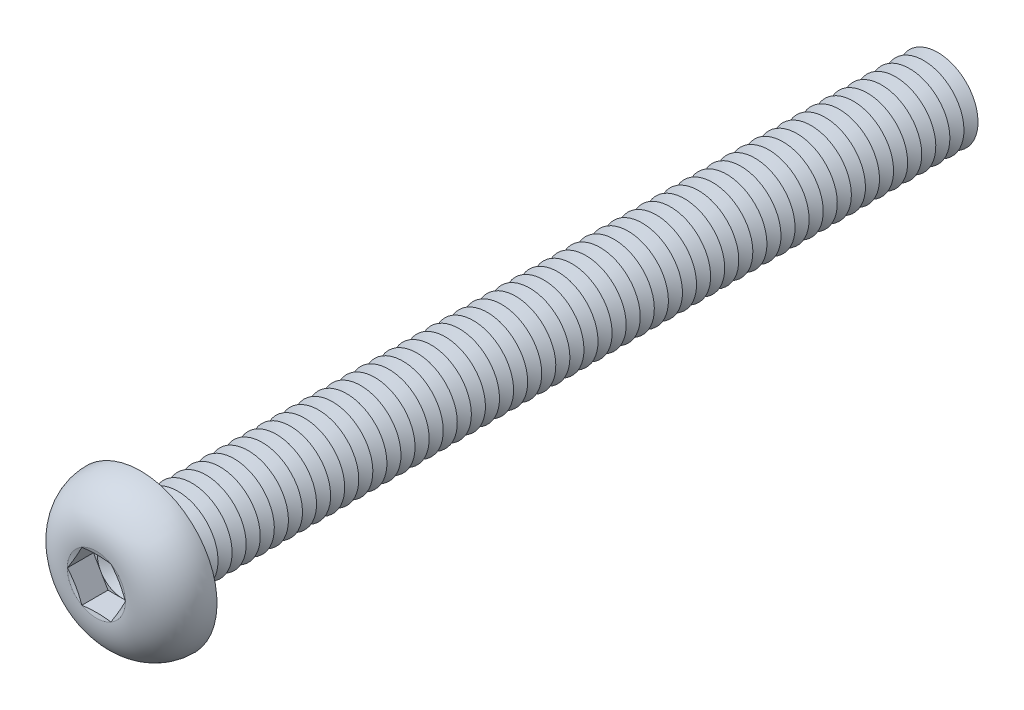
from build123d import *

# Parameters (mm, degrees)
FILLET1_R          = 0.35
LPATTERN1_COUNT    = 57
LPATTERN1_PITCH    = 0.7
CUT_EXTRUDE1_DEPTH = 1.3


with BuildPart() as part:
    # Sketch1 → Revolve1 (revolve)
    with BuildSketch(Plane(origin=(0, 0, 0), x_dir=(0, 0, -1), z_dir=(1, 0, 0))):
        with BuildLine():
            Line((0, 2), (0, 3.8))
            ThreePointArc((0, 3.8), (-1.611961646, 3.099623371), (-2.2, 1.443375))
            Line((-2.2, 1.443375), (-2.006624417, 0.7216875))
            Line((-2.006624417, 0.7216875), (-2.2, 0.7216875))
            Line((-2.2, 0.7216875), (-2.2, 0))
            Line((-2.2, 0), (40, 0))
            Line((40, 0), (40, 2))
            Line((40, 2), (0, 2))
        make_face()
    revolve(axis=Axis((0, 0, -40), (0, 0, 1)))

    # Fillet1
    fillet1_edges = [part.edges().sort_by_distance(p)[0] for p in [
        (0, -2, 0),
    ]]
    fillet(fillet1_edges, radius=FILLET1_R)

    # Sketch2 → Cut-Revolve1 (revolve, cut)
    with BuildSketch(Plane(origin=(0, 0, 0), x_dir=(0, 0, -1), z_dir=(1, 0, 0))):
        Polygon((39.65, 2), (40.35, 2), (40, 1.393782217), align=None)
    cut_revolve1 = revolve(axis=Axis((0, 0, -40), (0, 0, -1)), mode=Mode.SUBTRACT)

    # LPattern1: Cut-Revolve1 ×57
    with Locations(*[(0, 0, i * LPATTERN1_PITCH) for i in range(1, LPATTERN1_COUNT)]):
        add(cut_revolve1, mode=Mode.SUBTRACT)

    # Sketch3 → Cut-Extrude1 (cut)
    with BuildSketch(Plane.XY.offset(2.2)):
        Polygon((0.7216875, 1.249999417), (-0.7216875, 1.249999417), (-1.443375, 0), (-0.7216875, -1.249999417), (0.7216875, -1.249999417), (1.443375, 0), align=None)
    extrude(amount=-CUT_EXTRUDE1_DEPTH, mode=Mode.SUBTRACT)

    # Cut-Extrude2 cone 1 section (on through the dimple's axis) → Cut-Extrude2 (revolve, cut)
    with BuildSketch(Plane(origin=(0, 0, 0.9), x_dir=(0, -1, 0), z_dir=(1, 0, 0))):
        Polygon((0, 0), (1.249999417, 0), (0, 0.7216875), align=None)
    revolve(axis=Axis((0, 0, 0.9), (0, 0, -1)), mode=Mode.SUBTRACT)


solid = part.part
